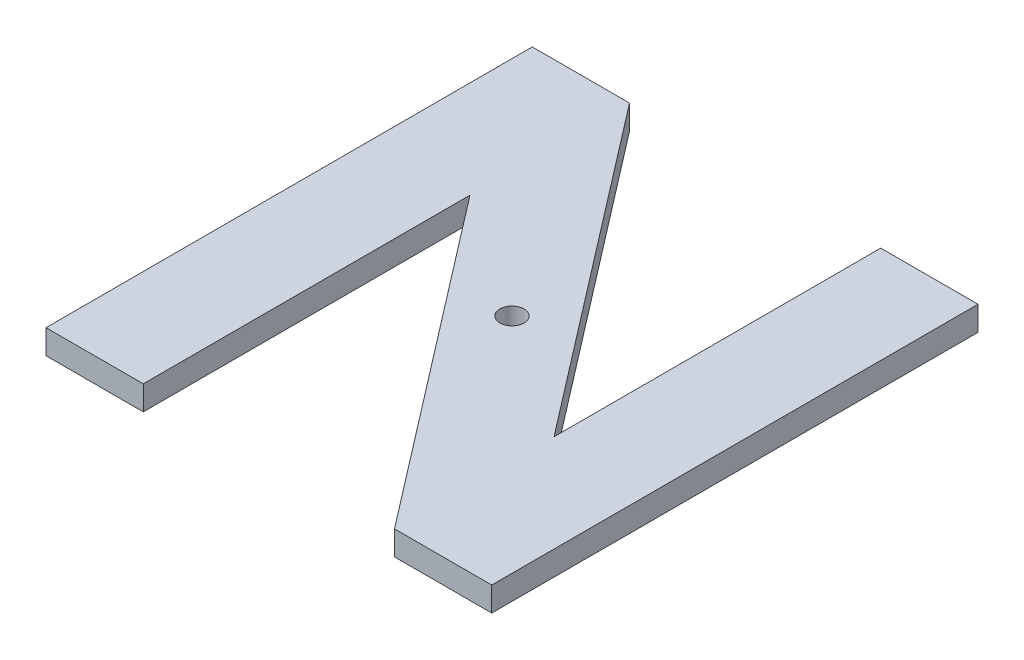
from build123d import *

# Parameters (mm, degrees)
SKETCH1_R      = 1.5
EXTRUDE1_DEPTH = 3


with BuildPart() as part:
    # Sketch1 → Extrude1 (new body)
    with BuildSketch(Plane(origin=(0, 0, 0), x_dir=(1, 0, 0), z_dir=(0, 1, 0))):
        Polygon((43, 19.685855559), (43, 60), (55, 60), (55, 0), (43, 0), (12, 40.314144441), (12, 0), (0, 0), (0, 60), (12, 60), align=None)
        with Locations(Location((27.5, 30, 0), (0, 0, 270))):
            Circle(SKETCH1_R, mode=Mode.SUBTRACT)
    extrude(amount=EXTRUDE1_DEPTH)


solid = part.part
